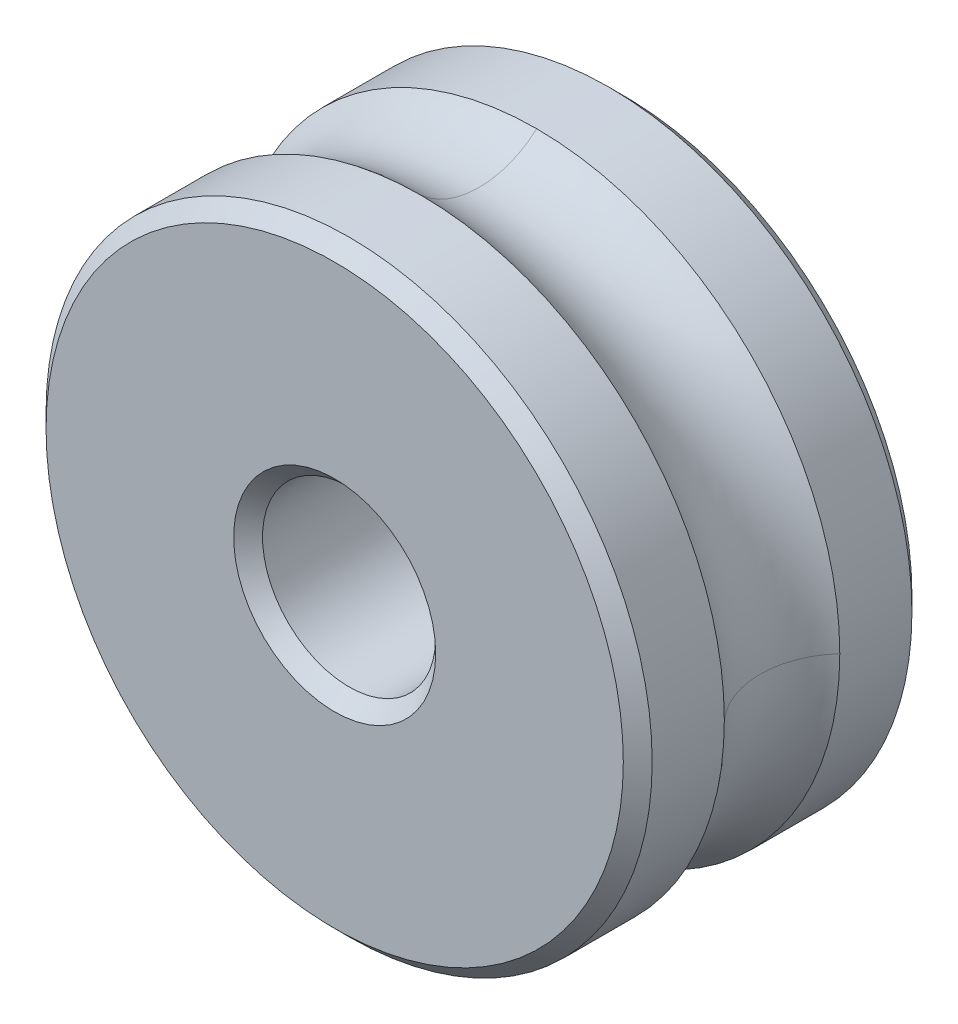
from build123d import *

# Parameters (mm, degrees)
SZKIC1_R                    = 21
SZKIC1_R_2                  = 6
DODANIE_WYCI_GNI_CIE1_DEPTH = 10
SFAZOWANIE1_SIZE            = 1
SZKIC3_R                    = 6


with BuildPart() as part:
    # Szkic1 → Dodanie-wyci_gni_cie1 (new, symmetric)
    with BuildSketch(Plane.XY):
        Circle(SZKIC1_R)
        Circle(SZKIC1_R_2, mode=Mode.SUBTRACT)
    extrude(amount=DODANIE_WYCI_GNI_CIE1_DEPTH, both=True)

    # Sfazowanie1
    sfazowanie1_edges = [part.edges().sort_by_distance(p)[0] for p in [
        (-21, 0, 10),
        (-21, 0, -10),
        (-6, 0, -10),
        (-6, 0, 10),
    ]]
    chamfer(sfazowanie1_edges, length=SFAZOWANIE1_SIZE)

    # Wyci_cie-wyci_gni_cie po _cie_ce1: sweep along a curve in space
    with BuildLine() as wyci_cie_wyci_gni_cie_po_cie_ce1_path:
        ThreePointArc((21, 0, -9), (14.849242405, 14.849242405, -9), (0, 21, -9))
        ThreePointArc((0, 21, -9), (-14.849242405, 14.849242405, -9), (-21, 0, -9))
        ThreePointArc((-21, 0, -9), (-14.849242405, -14.849242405, -9), (0, -21, -9))
        ThreePointArc((0, -21, -9), (14.849242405, -14.849242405, -9), (21, 0, -9))
    # Szkic3 → Wyci_cie-wyci_gni_cie po _cie_ce1 (sweep, cut)
    with BuildSketch(Plane(origin=(0, 0, 0), x_dir=(0, 0, -1), z_dir=(1, 0, 0))):
        with Locations((0, 25.472135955)):
            Circle(SZKIC3_R)
    sweep(path=wyci_cie_wyci_gni_cie_po_cie_ce1_path.line, mode=Mode.SUBTRACT)


solid = part.part
